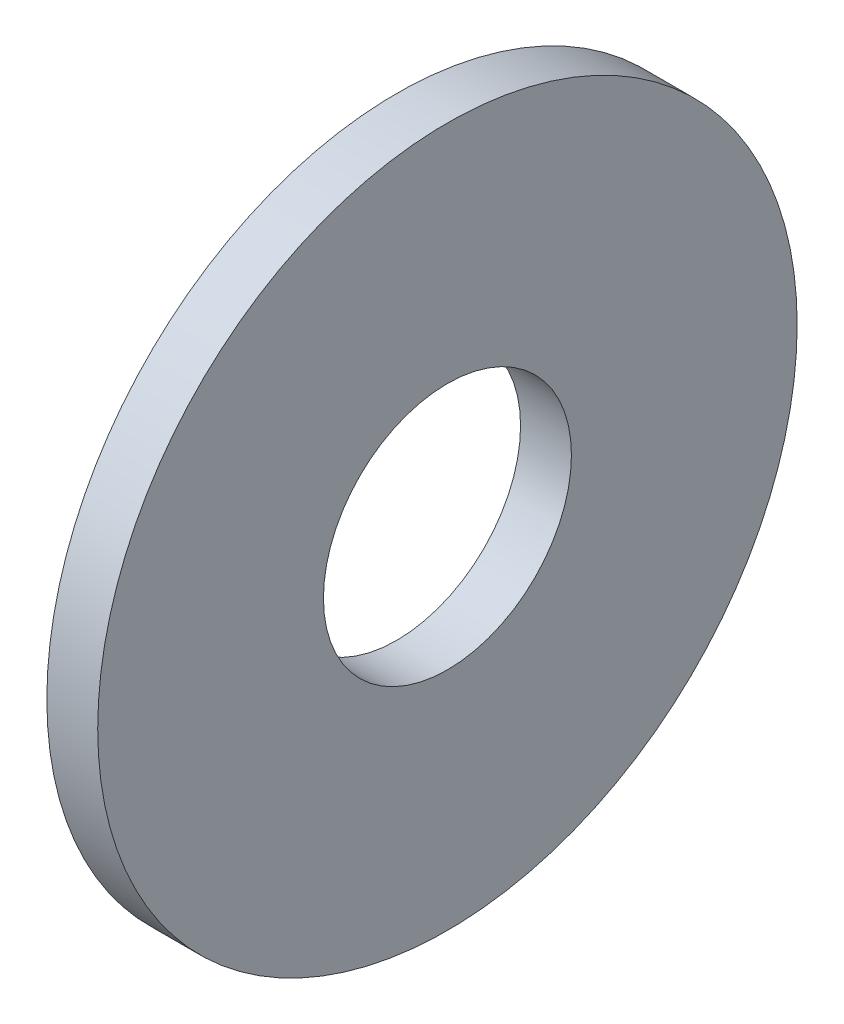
ISO-10303-21;
HEADER;
FILE_DESCRIPTION(('STEP AP214'),'2;1');
FILE_NAME('part.step','',(''),(''),'','','');
FILE_SCHEMA(('AUTOMOTIVE_DESIGN { 1 0 10303 214 1 1 1 1 }'));
ENDSEC;
DATA;
#1=APPLICATION_CONTEXT('core data for automotive mechanical design processes');
#2=APPLICATION_PROTOCOL_DEFINITION('international standard','automotive_design',2000,#1);
#3=PRODUCT_CONTEXT('',#1,'mechanical');
#4=PRODUCT('Part','Part','',(#3));
#5=PRODUCT_RELATED_PRODUCT_CATEGORY('part','',(#4));
#6=PRODUCT_DEFINITION_FORMATION('','',#4);
#7=PRODUCT_DEFINITION_CONTEXT('part definition',#1,'design');
#8=PRODUCT_DEFINITION('design','',#6,#7);
#9=PRODUCT_DEFINITION_SHAPE('','',#8);
#10=(LENGTH_UNIT() NAMED_UNIT(*) SI_UNIT(.MILLI.,.METRE.));
#11=(NAMED_UNIT(*) PLANE_ANGLE_UNIT() SI_UNIT($,.RADIAN.));
#12=(NAMED_UNIT(*) SI_UNIT($,.STERADIAN.) SOLID_ANGLE_UNIT());
#13=UNCERTAINTY_MEASURE_WITH_UNIT(LENGTH_MEASURE(1.E-05),#10,'distance_accuracy_value','');
#14=(GEOMETRIC_REPRESENTATION_CONTEXT(3) GLOBAL_UNCERTAINTY_ASSIGNED_CONTEXT((#13)) GLOBAL_UNIT_ASSIGNED_CONTEXT((#10,
#11,#12)) REPRESENTATION_CONTEXT('',''));
#15=CARTESIAN_POINT('',(0.,0.,0.));
#16=DIRECTION('',(0.,0.,1.));
#17=DIRECTION('',(1.,0.,0.));
#18=AXIS2_PLACEMENT_3D('',#15,#16,#17);
#19=CARTESIAN_POINT('',(-34.9249999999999,0.,0.));
#20=DIRECTION('',(-1.,0.,0.));
#21=DIRECTION('',(0.,0.,1.));
#22=AXIS2_PLACEMENT_3D('',#19,#20,#21);
#23=CYLINDRICAL_SURFACE('',#22,19.5);
#24=CARTESIAN_POINT('',(0.,0.,0.));
#25=DIRECTION('',(-1.,0.,0.));
#26=DIRECTION('',(0.,0.,1.));
#27=AXIS2_PLACEMENT_3D('',#24,#25,#26);
#28=CIRCLE('',#27,19.5);
#29=CARTESIAN_POINT('',(0.,0.,19.5));
#30=VERTEX_POINT('',#29);
#31=EDGE_CURVE('E10',#30,#30,#28,.T.);
#32=ORIENTED_EDGE('',*,*,#31,.F.);
#33=EDGE_LOOP('',(#32));
#34=FACE_BOUND('',#33,.T.);
#35=CARTESIAN_POINT('',(-8.,0.,0.));
#36=DIRECTION('',(-1.,0.,0.));
#37=DIRECTION('',(0.,0.,1.));
#38=AXIS2_PLACEMENT_3D('',#35,#36,#37);
#39=CIRCLE('',#38,19.5);
#40=CARTESIAN_POINT('',(-8.,0.,19.5));
#41=VERTEX_POINT('',#40);
#42=EDGE_CURVE('E45',#41,#41,#39,.T.);
#43=ORIENTED_EDGE('',*,*,#42,.T.);
#44=EDGE_LOOP('',(#43));
#45=FACE_BOUND('',#44,.T.);
#46=ADVANCED_FACE('F31',(#34,#45),#23,.F.);
#47=CARTESIAN_POINT('',(0.,19.5,0.));
#48=DIRECTION('',(-1.,0.,0.));
#49=DIRECTION('',(0.,0.,1.));
#50=AXIS2_PLACEMENT_3D('',#47,#48,#49);
#51=PLANE('',#50);
#52=CARTESIAN_POINT('',(0.,0.,0.));
#53=DIRECTION('',(-1.,0.,0.));
#54=DIRECTION('',(0.,0.,1.));
#55=AXIS2_PLACEMENT_3D('',#52,#53,#54);
#56=CIRCLE('',#55,55.);
#57=CARTESIAN_POINT('',(0.,0.,55.));
#58=VERTEX_POINT('',#57);
#59=EDGE_CURVE('E37',#58,#58,#56,.T.);
#60=ORIENTED_EDGE('',*,*,#59,.F.);
#61=EDGE_LOOP('',(#60));
#62=FACE_BOUND('',#61,.T.);
#63=ORIENTED_EDGE('',*,*,#31,.T.);
#64=EDGE_LOOP('',(#63));
#65=FACE_BOUND('',#64,.T.);
#66=ADVANCED_FACE('F60',(#62,#65),#51,.F.);
#67=CARTESIAN_POINT('',(-34.9249999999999,0.,0.));
#68=DIRECTION('',(-1.,0.,0.));
#69=DIRECTION('',(0.,0.,1.));
#70=AXIS2_PLACEMENT_3D('',#67,#68,#69);
#71=CYLINDRICAL_SURFACE('',#70,55.);
#72=CARTESIAN_POINT('',(-8.,0.,0.));
#73=DIRECTION('',(-1.,0.,0.));
#74=DIRECTION('',(0.,0.,1.));
#75=AXIS2_PLACEMENT_3D('',#72,#73,#74);
#76=CIRCLE('',#75,55.);
#77=CARTESIAN_POINT('',(-8.,0.,55.));
#78=VERTEX_POINT('',#77);
#79=EDGE_CURVE('E41',#78,#78,#76,.T.);
#80=ORIENTED_EDGE('',*,*,#79,.F.);
#81=EDGE_LOOP('',(#80));
#82=FACE_BOUND('',#81,.T.);
#83=ORIENTED_EDGE('',*,*,#59,.T.);
#84=EDGE_LOOP('',(#83));
#85=FACE_BOUND('',#84,.T.);
#86=ADVANCED_FACE('F55',(#82,#85),#71,.T.);
#87=CARTESIAN_POINT('',(-8.,55.,0.));
#88=DIRECTION('',(1.,0.,0.));
#89=DIRECTION('',(0.,0.,-1.));
#90=AXIS2_PLACEMENT_3D('',#87,#88,#89);
#91=PLANE('',#90);
#92=ORIENTED_EDGE('',*,*,#42,.F.);
#93=EDGE_LOOP('',(#92));
#94=FACE_BOUND('',#93,.T.);
#95=ORIENTED_EDGE('',*,*,#79,.T.);
#96=EDGE_LOOP('',(#95));
#97=FACE_BOUND('',#96,.T.);
#98=ADVANCED_FACE('F52',(#94,#97),#91,.F.);
#99=CLOSED_SHELL('',(#46,#66,#86,#98));
#100=MANIFOLD_SOLID_BREP('B2',#99);
#101=ADVANCED_BREP_SHAPE_REPRESENTATION('',(#18,#100),#14);
#102=SHAPE_DEFINITION_REPRESENTATION(#9,#101);
ENDSEC;
END-ISO-10303-21;
